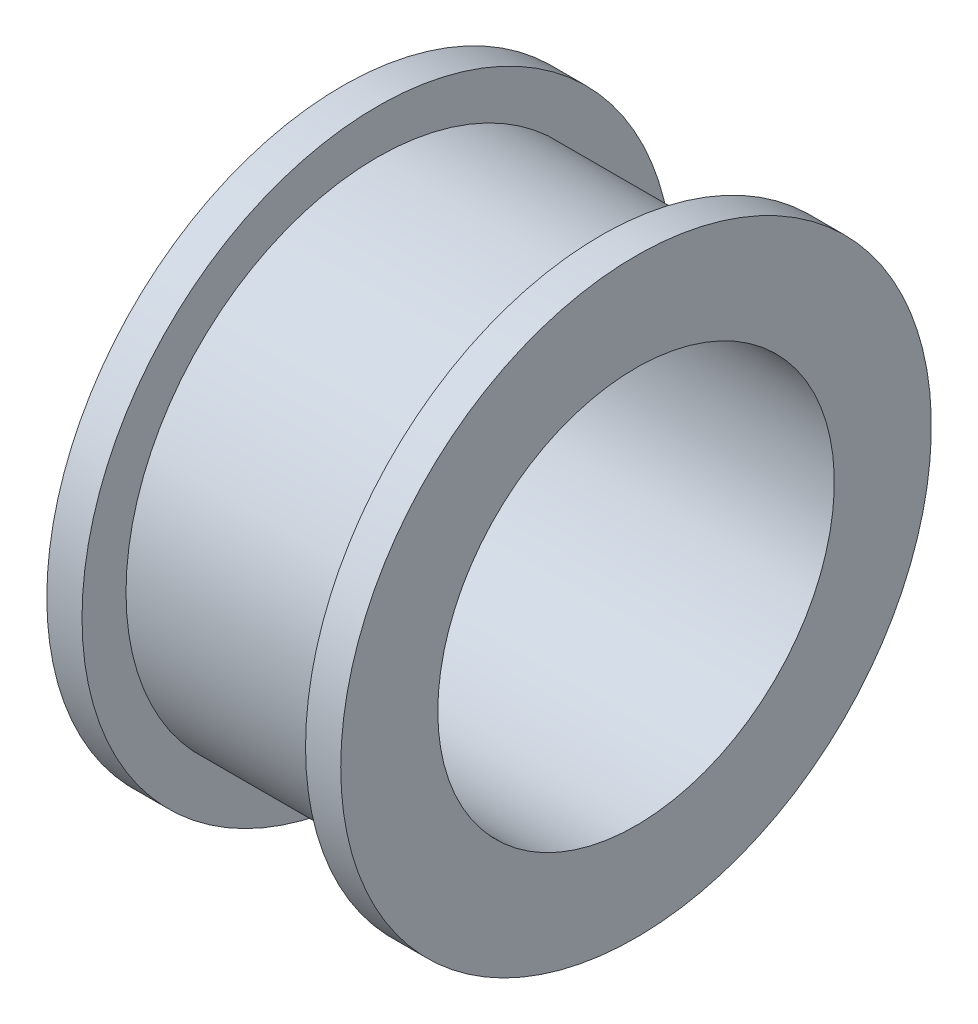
from build123d import *


with BuildPart() as part:
    # Sketch1 → Revolve1 (revolve)
    with BuildSketch(Plane.XY, mode=Mode.PRIVATE) as revolve1_sk:
        Polygon((-17.825638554, -0.69215), (-17.825638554, 6.3119), (-15.285638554, 6.3119), (-15.285638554, 3.1369), (0.843361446, 3.1369), (0.843361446, 6.3119), (3.383361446, 6.3119), (3.383361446, -0.69215), align=None)
    revolve(revolve1_sk.sketch.rotate(Axis((-37.366164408, -14.9987, 0), (1, 0, 0)), 90), axis=Axis((-37.366164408, -14.9987, 0), (1, 0, 0)))


solid = part.part
